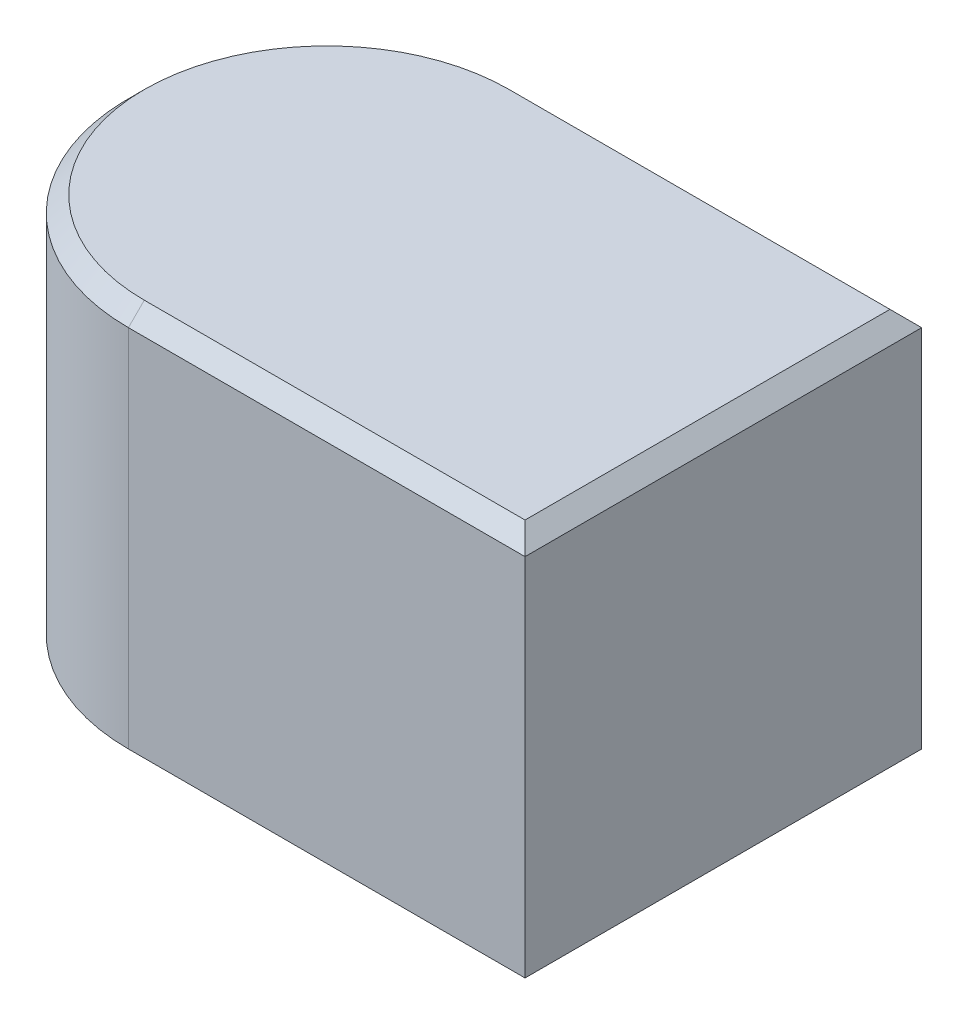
from build123d import *

# Parameters (mm, degrees)
BASE_EXTRUSION_DEPTH = 4
CHANFREIN1_SIZE      = 0.16


with BuildPart() as part:
    # Esquisse1 → Base-Extrusion (new body)
    with BuildSketch(Plane(origin=(0, 0, 0), x_dir=(1, 0, 0), z_dir=(0, 1, 0))):
        with BuildLine():
            Line((4, 2), (0, 2))
            ThreePointArc((0, 2), (-2, 0), (0, -2))
            Line((0, -2), (4, -2))
            Line((4, -2), (4, 2))
        make_face()
    extrude(amount=BASE_EXTRUSION_DEPTH)

    # Chanfrein1
    chanfrein1_edges = [part.edges().sort_by_distance(p)[0] for p in [
        (-2, 0, 0),
        (-2, 4, 0),
        (2, 0, 2),
        (2, 4, 2),
        (4, 0, 0),
        (4, 4, 0),
        (2, 0, -2),
        (2, 4, -2),
    ]]
    chamfer(chanfrein1_edges, length=CHANFREIN1_SIZE)


solid = part.part
